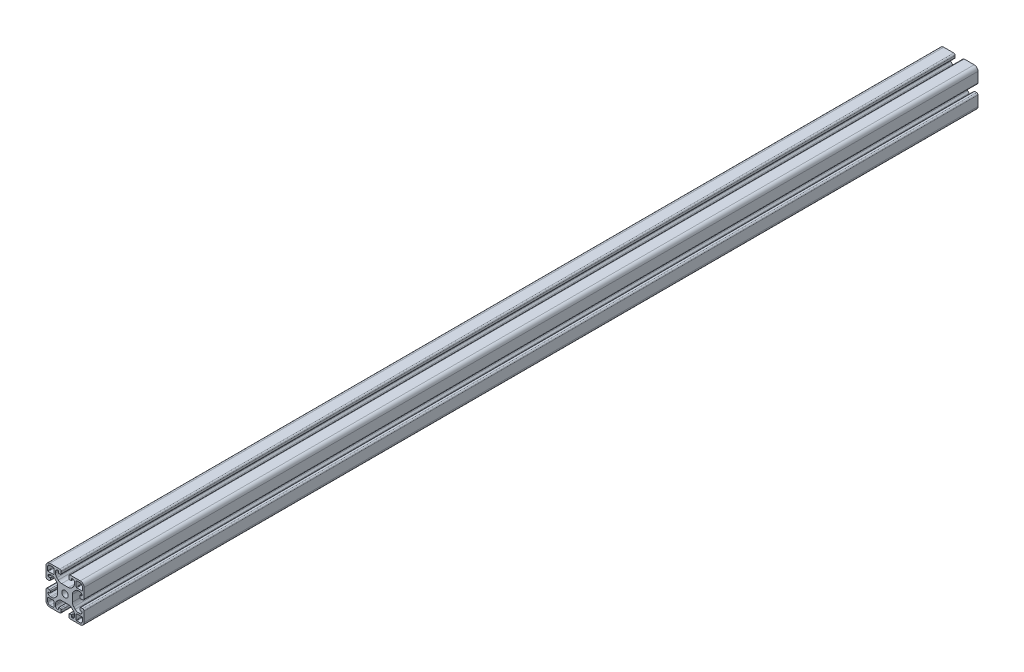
from build123d import *

# Parameters (mm, degrees)
SKETCH1_R           = 3.4
BOSS_EXTRUDE1_DEPTH = 470


with BuildPart() as part:
    # Sketch1 → Boss-Extrude1 (new, symmetric)
    with BuildSketch(Plane(origin=(0, 0, 0), x_dir=(-1, 0, 0), z_dir=(0, 0, -1))):
        with BuildLine():
            Line((-36.5, 16), (-38.5, 16))
            ThreePointArc((-38.5, 16), (-39.560660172, 15.560660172), (-40, 14.5))
            Line((-40, 14.5), (-40, 4))
            ThreePointArc((-40, 4), (-38.828427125, 1.171572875), (-36, 0))
            Line((-36, 0), (-25.5, 0))
            ThreePointArc((-25.5, 0), (-24.439339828, 0.439339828), (-24, 1.5))
            Line((-24, 1.5), (-24, 3.5))
            ThreePointArc((-24, 3.5), (-24.292893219, 4.207106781), (-25, 4.5))
            Line((-25, 4.5), (-26.5, 4.5))
            ThreePointArc((-26.5, 4.5), (-26.853553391, 4.353553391), (-27, 4))
            Line((-27, 4), (-27, 2.5))
            ThreePointArc((-27, 2.5), (-27.146446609, 2.146446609), (-27.5, 2))
            ThreePointArc((-27.5, 2), (-29.267766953, 2.732233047), (-30, 4.5))
            Line((-30, 4.5), (-30, 5.807611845))
            ThreePointArc((-30, 5.807611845), (-29.619397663, 7.721029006), (-28.535533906, 9.343145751))
            Line((-28.535533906, 9.343145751), (-27.09314575, 10.785533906))
            ThreePointArc((-27.09314575, 10.785533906), (-25.471029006, 11.869397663), (-23.557611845, 12.25))
            Line((-23.557611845, 12.25), (-16.442388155, 12.25))
            ThreePointArc((-16.442388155, 12.25), (-14.528970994, 11.869397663), (-12.90685425, 10.785533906))
            Line((-12.90685425, 10.785533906), (-11.464466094, 9.343145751))
            ThreePointArc((-11.464466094, 9.343145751), (-10.380602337, 7.721029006), (-10, 5.807611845))
            Line((-10, 5.807611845), (-10, 4.5))
            ThreePointArc((-10, 4.5), (-10.732233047, 2.732233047), (-12.5, 2))
            ThreePointArc((-12.5, 2), (-12.853553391, 2.146446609), (-13, 2.5))
            Line((-13, 2.5), (-13, 4))
            ThreePointArc((-13, 4), (-13.146446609, 4.353553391), (-13.5, 4.5))
            Line((-13.5, 4.5), (-15, 4.5))
            ThreePointArc((-15, 4.5), (-15.707106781, 4.207106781), (-16, 3.5))
            Line((-16, 3.5), (-16, 1.5))
            ThreePointArc((-16, 1.5), (-15.560660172, 0.439339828), (-14.5, 0))
            Line((-14.5, 0), (-4, 0))
            ThreePointArc((-4, 0), (-1.171572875, 1.171572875), (0, 4))
            Line((0, 4), (0, 14.5))
            ThreePointArc((0, 14.5), (-0.439339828, 15.560660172), (-1.5, 16))
            Line((-1.5, 16), (-3.5, 16))
            ThreePointArc((-3.5, 16), (-4.207106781, 15.707106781), (-4.5, 15))
            Line((-4.5, 15), (-4.5, 13.5))
            ThreePointArc((-4.5, 13.5), (-4.353553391, 13.146446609), (-4, 13))
            Line((-4, 13), (-2.5, 13))
            ThreePointArc((-2.5, 13), (-2.146446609, 12.853553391), (-2, 12.5))
            ThreePointArc((-2, 12.5), (-2.732233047, 10.732233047), (-4.5, 10))
            Line((-4.5, 10), (-5.807611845, 10))
            ThreePointArc((-5.807611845, 10), (-7.721029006, 10.380602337), (-9.343145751, 11.464466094))
            Line((-9.343145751, 11.464466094), (-10.785533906, 12.906854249))
            ThreePointArc((-10.785533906, 12.906854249), (-11.869397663, 14.528970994), (-12.25, 16.442388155))
            Line((-12.25, 16.442388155), (-12.25, 23.557611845))
            ThreePointArc((-12.25, 23.557611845), (-11.869397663, 25.471029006), (-10.785533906, 27.093145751))
            Line((-10.785533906, 27.093145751), (-9.343145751, 28.535533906))
            ThreePointArc((-9.343145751, 28.535533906), (-7.721029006, 29.619397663), (-5.807611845, 30))
            Line((-5.807611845, 30), (-4.5, 30))
            ThreePointArc((-4.5, 30), (-2.732233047, 29.267766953), (-2, 27.5))
            ThreePointArc((-2, 27.5), (-2.146446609, 27.146446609), (-2.5, 27))
            Line((-2.5, 27), (-4, 27))
            ThreePointArc((-4, 27), (-4.353553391, 26.853553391), (-4.5, 26.5))
            Line((-4.5, 26.5), (-4.5, 25))
            ThreePointArc((-4.5, 25), (-4.207106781, 24.292893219), (-3.5, 24))
            Line((-3.5, 24), (-1.5, 24))
            ThreePointArc((-1.5, 24), (-0.439339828, 24.439339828), (0, 25.5))
            Line((0, 25.5), (0, 36))
            ThreePointArc((0, 36), (-1.171572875, 38.828427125), (-4, 40))
            Line((-4, 40), (-14.5, 40))
            ThreePointArc((-14.5, 40), (-15.560660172, 39.560660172), (-16, 38.5))
            Line((-16, 38.5), (-16, 36.5))
            ThreePointArc((-16, 36.5), (-15.707106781, 35.792893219), (-15, 35.5))
            Line((-15, 35.5), (-13.5, 35.5))
            ThreePointArc((-13.5, 35.5), (-13.146446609, 35.646446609), (-13, 36))
            Line((-13, 36), (-13, 37.5))
            ThreePointArc((-13, 37.5), (-12.853553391, 37.853553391), (-12.5, 38))
            ThreePointArc((-12.5, 38), (-10.732233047, 37.267766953), (-10, 35.5))
            Line((-10, 35.5), (-10, 34.192388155))
            ThreePointArc((-10, 34.192388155), (-10.380602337, 32.278970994), (-11.464466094, 30.656854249))
            Line((-11.464466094, 30.656854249), (-12.90685425, 29.214466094))
            ThreePointArc((-12.90685425, 29.214466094), (-14.528970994, 28.130602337), (-16.442388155, 27.75))
            Line((-16.442388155, 27.75), (-23.557611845, 27.75))
            ThreePointArc((-23.557611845, 27.75), (-25.471029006, 28.130602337), (-27.09314575, 29.214466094))
            Line((-27.09314575, 29.214466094), (-28.535533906, 30.656854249))
            ThreePointArc((-28.535533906, 30.656854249), (-29.619397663, 32.278970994), (-30, 34.192388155))
            Line((-30, 34.192388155), (-30, 35.5))
            ThreePointArc((-30, 35.5), (-29.267766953, 37.267766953), (-27.5, 38))
            ThreePointArc((-27.5, 38), (-27.146446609, 37.853553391), (-27, 37.5))
            Line((-27, 37.5), (-27, 36))
            ThreePointArc((-27, 36), (-26.853553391, 35.646446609), (-26.5, 35.5))
            Line((-26.5, 35.5), (-25, 35.5))
            ThreePointArc((-25, 35.5), (-24.292893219, 35.792893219), (-24, 36.5))
            Line((-24, 36.5), (-24, 38.5))
            ThreePointArc((-24, 38.5), (-24.439339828, 39.560660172), (-25.5, 40))
            Line((-25.5, 40), (-36, 40))
            ThreePointArc((-36, 40), (-38.828427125, 38.828427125), (-40, 36))
            Line((-40, 36), (-40, 25.5))
            ThreePointArc((-40, 25.5), (-39.560660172, 24.439339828), (-38.5, 24))
            Line((-38.5, 24), (-36.5, 24))
            ThreePointArc((-36.5, 24), (-35.792893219, 24.292893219), (-35.5, 25))
            Line((-35.5, 25), (-35.5, 26.5))
            ThreePointArc((-35.5, 26.5), (-35.646446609, 26.853553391), (-36, 27))
            Line((-36, 27), (-37.5, 27))
            ThreePointArc((-37.5, 27), (-37.853553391, 27.146446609), (-38, 27.5))
            ThreePointArc((-38, 27.5), (-37.267766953, 29.267766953), (-35.5, 30))
            Line((-35.5, 30), (-34.192388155, 30))
            ThreePointArc((-34.192388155, 30), (-32.278970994, 29.619397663), (-30.656854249, 28.535533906))
            Line((-30.656854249, 28.535533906), (-29.214466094, 27.093145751))
            ThreePointArc((-29.214466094, 27.093145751), (-28.130602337, 25.471029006), (-27.75, 23.557611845))
            Line((-27.75, 23.557611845), (-27.75, 16.442388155))
            ThreePointArc((-27.75, 16.442388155), (-28.130602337, 14.528970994), (-29.214466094, 12.906854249))
            Line((-29.214466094, 12.906854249), (-30.656854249, 11.464466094))
            ThreePointArc((-30.656854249, 11.464466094), (-32.278970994, 10.380602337), (-34.192388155, 10))
            Line((-34.192388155, 10), (-35.5, 10))
            ThreePointArc((-35.5, 10), (-37.267766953, 10.732233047), (-38, 12.5))
            ThreePointArc((-38, 12.5), (-37.853553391, 12.853553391), (-37.5, 13))
            Line((-37.5, 13), (-36, 13))
            ThreePointArc((-36, 13), (-35.646446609, 13.146446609), (-35.5, 13.5))
            Line((-35.5, 13.5), (-35.5, 15))
            ThreePointArc((-35.5, 15), (-35.792893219, 15.707106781), (-36.5, 16))
        make_face()
        with Locations((-20, 20)):
            Circle(SKETCH1_R, mode=Mode.SUBTRACT)
        with BuildLine():
            Line((-36, 38.2), (-32.3, 38.2))
            ThreePointArc((-32.3, 38.2), (-31.946446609, 38.053553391), (-31.8, 37.7))
            Line((-31.8, 37.7), (-31.8, 32.3))
            ThreePointArc((-31.8, 32.3), (-31.946446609, 31.946446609), (-32.3, 31.8))
            Line((-32.3, 31.8), (-37.7, 31.8))
            ThreePointArc((-37.7, 31.8), (-38.053553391, 31.946446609), (-38.2, 32.3))
            Line((-38.2, 32.3), (-38.2, 36))
            ThreePointArc((-38.2, 36), (-37.555634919, 37.555634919), (-36, 38.2))
        make_face(mode=Mode.SUBTRACT)
        with BuildLine():
            Line((-32.3, 1.8), (-36, 1.8))
            ThreePointArc((-36, 1.8), (-37.555634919, 2.444365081), (-38.2, 4))
            Line((-38.2, 4), (-38.2, 7.7))
            ThreePointArc((-38.2, 7.7), (-38.053553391, 8.053553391), (-37.7, 8.2))
            Line((-37.7, 8.2), (-32.3, 8.2))
            ThreePointArc((-32.3, 8.2), (-31.946446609, 8.053553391), (-31.8, 7.7))
            Line((-31.8, 7.7), (-31.8, 2.3))
            ThreePointArc((-31.8, 2.3), (-31.946446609, 1.946446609), (-32.3, 1.8))
        make_face(mode=Mode.SUBTRACT)
        with BuildLine():
            Line((-4, 1.8), (-7.7, 1.8))
            ThreePointArc((-7.7, 1.8), (-8.053553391, 1.946446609), (-8.2, 2.3))
            Line((-8.2, 2.3), (-8.2, 7.7))
            ThreePointArc((-8.2, 7.7), (-8.053553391, 8.053553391), (-7.7, 8.2))
            Line((-7.7, 8.2), (-2.3, 8.2))
            ThreePointArc((-2.3, 8.2), (-1.946446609, 8.053553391), (-1.8, 7.7))
            Line((-1.8, 7.7), (-1.8, 4))
            ThreePointArc((-1.8, 4), (-2.444365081, 2.444365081), (-4, 1.8))
        make_face(mode=Mode.SUBTRACT)
        with BuildLine():
            Line((-7.7, 38.2), (-4, 38.2))
            ThreePointArc((-4, 38.2), (-2.444365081, 37.555634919), (-1.8, 36))
            Line((-1.8, 36), (-1.8, 32.3))
            ThreePointArc((-1.8, 32.3), (-1.946446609, 31.946446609), (-2.3, 31.8))
            Line((-2.3, 31.8), (-7.7, 31.8))
            ThreePointArc((-7.7, 31.8), (-8.053553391, 31.946446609), (-8.2, 32.3))
            Line((-8.2, 32.3), (-8.2, 37.7))
            ThreePointArc((-8.2, 37.7), (-8.053553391, 38.053553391), (-7.7, 38.2))
        make_face(mode=Mode.SUBTRACT)
    extrude(amount=BOSS_EXTRUDE1_DEPTH, both=True)


solid = part.part
